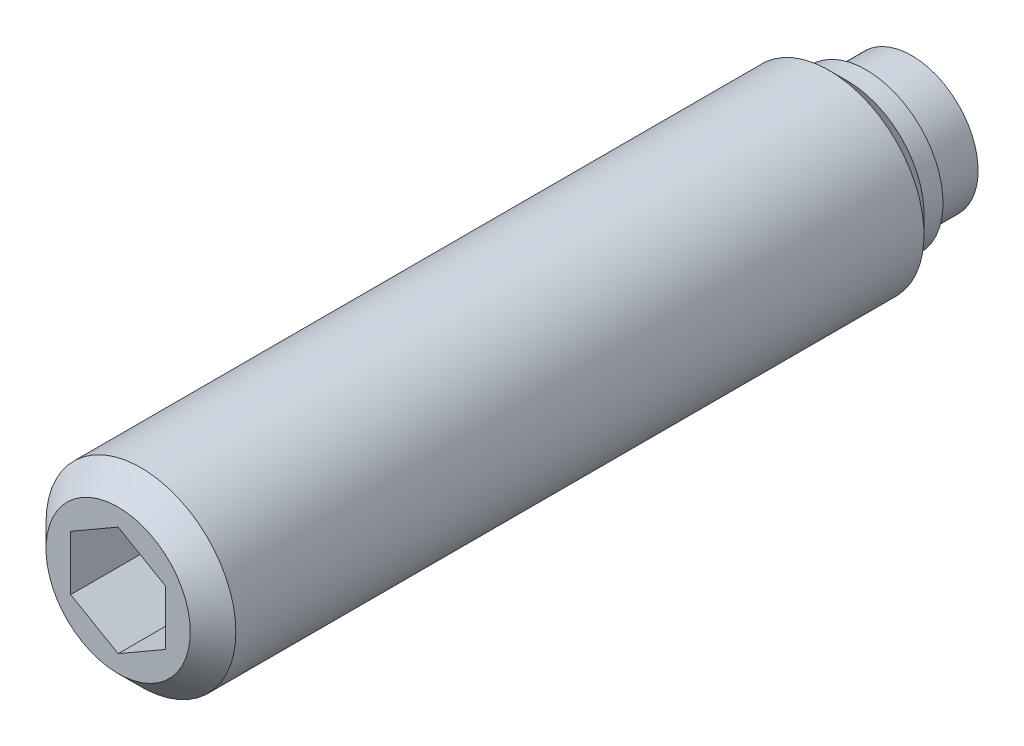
ISO-10303-21;
HEADER;
FILE_DESCRIPTION(('STEP AP214'),'2;1');
FILE_NAME('part.step','',(''),(''),'','','');
FILE_SCHEMA(('AUTOMOTIVE_DESIGN { 1 0 10303 214 1 1 1 1 }'));
ENDSEC;
DATA;
#1=APPLICATION_CONTEXT('core data for automotive mechanical design processes');
#2=APPLICATION_PROTOCOL_DEFINITION('international standard','automotive_design',2000,#1);
#3=PRODUCT_CONTEXT('',#1,'mechanical');
#4=PRODUCT('Part','Part','',(#3));
#5=PRODUCT_RELATED_PRODUCT_CATEGORY('part','',(#4));
#6=PRODUCT_DEFINITION_FORMATION('','',#4);
#7=PRODUCT_DEFINITION_CONTEXT('part definition',#1,'design');
#8=PRODUCT_DEFINITION('design','',#6,#7);
#9=PRODUCT_DEFINITION_SHAPE('','',#8);
#10=(LENGTH_UNIT() NAMED_UNIT(*) SI_UNIT(.MILLI.,.METRE.));
#11=(NAMED_UNIT(*) PLANE_ANGLE_UNIT() SI_UNIT($,.RADIAN.));
#12=(NAMED_UNIT(*) SI_UNIT($,.STERADIAN.) SOLID_ANGLE_UNIT());
#13=UNCERTAINTY_MEASURE_WITH_UNIT(LENGTH_MEASURE(1.E-05),#10,'distance_accuracy_value','');
#14=(GEOMETRIC_REPRESENTATION_CONTEXT(3) GLOBAL_UNCERTAINTY_ASSIGNED_CONTEXT((#13)) GLOBAL_UNIT_ASSIGNED_CONTEXT((#10,
#11,#12)) REPRESENTATION_CONTEXT('',''));
#15=CARTESIAN_POINT('',(0.,0.,0.));
#16=DIRECTION('',(0.,0.,1.));
#17=DIRECTION('',(1.,0.,0.));
#18=AXIS2_PLACEMENT_3D('',#15,#16,#17);
#19=CARTESIAN_POINT('',(0.,4.05,3.5));
#20=DIRECTION('',(0.,0.,1.));
#21=DIRECTION('',(1.,0.,0.));
#22=AXIS2_PLACEMENT_3D('',#19,#20,#21);
#23=PLANE('',#22);
#24=CARTESIAN_POINT('',(0.,0.,3.5));
#25=DIRECTION('',(0.,0.,-1.));
#26=DIRECTION('',(-1.,0.,0.));
#27=AXIS2_PLACEMENT_3D('',#24,#25,#26);
#28=CIRCLE('',#27,3.5);
#29=CARTESIAN_POINT('',(-3.50000000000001,0.,3.5));
#30=VERTEX_POINT('',#29);
#31=EDGE_CURVE('E124',#30,#30,#28,.T.);
#32=ORIENTED_EDGE('',*,*,#31,.F.);
#33=EDGE_LOOP('',(#32));
#34=FACE_BOUND('',#33,.T.);
#35=CARTESIAN_POINT('',(0.,0.,3.5));
#36=DIRECTION('',(0.,0.,-1.));
#37=DIRECTION('',(-1.,0.,0.));
#38=AXIS2_PLACEMENT_3D('',#35,#36,#37);
#39=CIRCLE('',#38,4.05);
#40=CARTESIAN_POINT('',(-4.05000000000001,0.,3.5));
#41=VERTEX_POINT('',#40);
#42=EDGE_CURVE('E127',#41,#41,#39,.T.);
#43=ORIENTED_EDGE('',*,*,#42,.T.);
#44=EDGE_LOOP('',(#43));
#45=FACE_BOUND('',#44,.T.);
#46=ADVANCED_FACE('F14',(#34,#45),#23,.F.);
#47=CARTESIAN_POINT('',(0.,0.,3.5));
#48=DIRECTION('',(0.,0.,-1.));
#49=DIRECTION('',(-1.,0.,0.));
#50=AXIS2_PLACEMENT_3D('',#47,#48,#49);
#51=CYLINDRICAL_SURFACE('',#50,5.);
#52=CARTESIAN_POINT('',(0.,0.,41.7));
#53=DIRECTION('',(0.,0.,1.));
#54=DIRECTION('',(1.,0.,0.));
#55=AXIS2_PLACEMENT_3D('',#52,#53,#54);
#56=CIRCLE('',#55,5.);
#57=CARTESIAN_POINT('',(4.99999999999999,0.,41.7));
#58=VERTEX_POINT('',#57);
#59=EDGE_CURVE('E9',#58,#58,#56,.F.);
#60=ORIENTED_EDGE('',*,*,#59,.T.);
#61=EDGE_LOOP('',(#60));
#62=FACE_BOUND('',#61,.T.);
#63=CARTESIAN_POINT('',(0.,0.,5.45));
#64=DIRECTION('',(0.,0.,-1.));
#65=DIRECTION('',(-1.,0.,0.));
#66=AXIS2_PLACEMENT_3D('',#63,#64,#65);
#67=CIRCLE('',#66,5.);
#68=CARTESIAN_POINT('',(-5.00000000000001,0.,5.45));
#69=VERTEX_POINT('',#68);
#70=EDGE_CURVE('E133',#69,#69,#67,.T.);
#71=ORIENTED_EDGE('',*,*,#70,.F.);
#72=EDGE_LOOP('',(#71));
#73=FACE_BOUND('',#72,.T.);
#74=ADVANCED_FACE('F151',(#62,#73),#51,.T.);
#75=CARTESIAN_POINT('',(0.,0.,5.45));
#76=DIRECTION('',(0.,0.,1.));
#77=DIRECTION('',(1.,0.,0.));
#78=AXIS2_PLACEMENT_3D('',#75,#76,#77);
#79=CONICAL_SURFACE('',#78,5.,0.785398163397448);
#80=CARTESIAN_POINT('',(0.,0.,4.5));
#81=DIRECTION('',(0.,0.,-1.));
#82=DIRECTION('',(-1.,0.,0.));
#83=AXIS2_PLACEMENT_3D('',#80,#81,#82);
#84=CIRCLE('',#83,4.05);
#85=CARTESIAN_POINT('',(-4.05000000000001,0.,4.5));
#86=VERTEX_POINT('',#85);
#87=EDGE_CURVE('E130',#86,#86,#84,.T.);
#88=ORIENTED_EDGE('',*,*,#87,.F.);
#89=EDGE_LOOP('',(#88));
#90=FACE_BOUND('',#89,.T.);
#91=ORIENTED_EDGE('',*,*,#70,.T.);
#92=EDGE_LOOP('',(#91));
#93=FACE_BOUND('',#92,.T.);
#94=ADVANCED_FACE('F158',(#90,#93),#79,.T.);
#95=CARTESIAN_POINT('',(0.,0.,3.5));
#96=DIRECTION('',(0.,0.,-1.));
#97=DIRECTION('',(-1.,0.,0.));
#98=AXIS2_PLACEMENT_3D('',#95,#96,#97);
#99=CYLINDRICAL_SURFACE('',#98,4.05);
#100=ORIENTED_EDGE('',*,*,#42,.F.);
#101=EDGE_LOOP('',(#100));
#102=FACE_BOUND('',#101,.T.);
#103=ORIENTED_EDGE('',*,*,#87,.T.);
#104=EDGE_LOOP('',(#103));
#105=FACE_BOUND('',#104,.T.);
#106=ADVANCED_FACE('F166',(#102,#105),#99,.T.);
#107=CARTESIAN_POINT('',(0.,0.,0.));
#108=DIRECTION('',(0.,0.,-1.));
#109=DIRECTION('',(-1.,0.,0.));
#110=AXIS2_PLACEMENT_3D('',#107,#108,#109);
#111=CYLINDRICAL_SURFACE('',#110,3.5);
#112=CARTESIAN_POINT('',(0.,0.,1.1));
#113=DIRECTION('',(0.,0.,-1.));
#114=DIRECTION('',(-1.,0.,0.));
#115=AXIS2_PLACEMENT_3D('',#112,#113,#114);
#116=CIRCLE('',#115,3.5);
#117=CARTESIAN_POINT('',(-3.50000000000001,0.,1.1));
#118=VERTEX_POINT('',#117);
#119=EDGE_CURVE('E114',#118,#118,#116,.T.);
#120=ORIENTED_EDGE('',*,*,#119,.F.);
#121=EDGE_LOOP('',(#120));
#122=FACE_BOUND('',#121,.T.);
#123=ORIENTED_EDGE('',*,*,#31,.T.);
#124=EDGE_LOOP('',(#123));
#125=FACE_BOUND('',#124,.T.);
#126=ADVANCED_FACE('F164',(#122,#125),#111,.T.);
#127=CARTESIAN_POINT('',(-0.0371790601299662,0.,5.9998848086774));
#128=DIRECTION('',(0.,-1.,0.));
#129=DIRECTION('',(-1.,0.,0.));
#130=AXIS2_PLACEMENT_3D('',#127,#128,#129);
#131=CIRCLE('',#130,5.99999999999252);
#132=TRIMMED_CURVE('',#131,(PARAMETER_VALUE(-1.57699287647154)),
(PARAMETER_VALUE(1.57699287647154)),.T.,.PARAMETER.);
#133=CARTESIAN_POINT('',(0.,0.,5.9998848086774));
#134=DIRECTION('',(0.,0.,-1.));
#135=AXIS1_PLACEMENT('',#133,#134);
#136=SURFACE_OF_REVOLUTION('',#132,#135);
#137=ORIENTED_EDGE('',*,*,#119,.T.);
#138=EDGE_LOOP('',(#137));
#139=FACE_BOUND('',#138,.T.);
#140=CARTESIAN_POINT('',(0.,0.,0.));
#141=VERTEX_POINT('',#140);
#142=VERTEX_LOOP('',#141);
#143=FACE_BOUND('',#142,.T.);
#144=ADVANCED_FACE('F198',(#139,#143),#136,.T.);
#145=CARTESIAN_POINT('',(0.,0.,42.9));
#146=DIRECTION('',(0.,0.,1.));
#147=DIRECTION('',(1.,0.,0.));
#148=AXIS2_PLACEMENT_3D('',#145,#146,#147);
#149=PLANE('',#148);
#150=CARTESIAN_POINT('',(0.,0.,42.9));
#151=DIRECTION('',(0.,0.,1.));
#152=DIRECTION('',(1.,0.,0.));
#153=AXIS2_PLACEMENT_3D('',#150,#151,#152);
#154=CIRCLE('',#153,3.8);
#155=CARTESIAN_POINT('',(3.79999999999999,0.,42.9));
#156=VERTEX_POINT('',#155);
#157=EDGE_CURVE('E22',#156,#156,#154,.T.);
#158=ORIENTED_EDGE('',*,*,#157,.T.);
#159=EDGE_LOOP('',(#158));
#160=FACE_BOUND('',#159,.T.);
#161=DIRECTION('',(-0.866025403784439,0.5,0.));
#162=VECTOR('',#161,1.);
#163=CARTESIAN_POINT('',(2.5,1.44337567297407,42.9));
#164=LINE('',#163,#162);
#165=CARTESIAN_POINT('',(2.5,1.44337567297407,42.9));
#166=VERTEX_POINT('',#165);
#167=CARTESIAN_POINT('',(0.,2.88675134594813,42.9));
#168=VERTEX_POINT('',#167);
#169=EDGE_CURVE('E29',#166,#168,#164,.T.);
#170=ORIENTED_EDGE('',*,*,#169,.F.);
#171=DIRECTION('',(0.,1.,0.));
#172=VECTOR('',#171,1.);
#173=CARTESIAN_POINT('',(2.5,-1.44337567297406,42.9));
#174=LINE('',#173,#172);
#175=CARTESIAN_POINT('',(2.5,-1.44337567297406,42.9));
#176=VERTEX_POINT('',#175);
#177=EDGE_CURVE('E88',#176,#166,#174,.T.);
#178=ORIENTED_EDGE('',*,*,#177,.F.);
#179=DIRECTION('',(0.866025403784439,0.5,0.));
#180=VECTOR('',#179,1.);
#181=CARTESIAN_POINT('',(0.,-2.88675134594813,42.9));
#182=LINE('',#181,#180);
#183=CARTESIAN_POINT('',(0.,-2.88675134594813,42.9));
#184=VERTEX_POINT('',#183);
#185=EDGE_CURVE('E91',#184,#176,#182,.T.);
#186=ORIENTED_EDGE('',*,*,#185,.F.);
#187=DIRECTION('',(0.866025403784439,-0.5,0.));
#188=VECTOR('',#187,1.);
#189=CARTESIAN_POINT('',(-2.5,-1.44337567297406,42.9));
#190=LINE('',#189,#188);
#191=CARTESIAN_POINT('',(-2.5,-1.44337567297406,42.9));
#192=VERTEX_POINT('',#191);
#193=EDGE_CURVE('E107',#192,#184,#190,.T.);
#194=ORIENTED_EDGE('',*,*,#193,.F.);
#195=DIRECTION('',(0.,-1.,0.));
#196=VECTOR('',#195,1.);
#197=CARTESIAN_POINT('',(-2.5,1.44337567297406,42.9));
#198=LINE('',#197,#196);
#199=CARTESIAN_POINT('',(-2.5,1.44337567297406,42.9));
#200=VERTEX_POINT('',#199);
#201=EDGE_CURVE('E104',#200,#192,#198,.T.);
#202=ORIENTED_EDGE('',*,*,#201,.F.);
#203=DIRECTION('',(-0.866025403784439,-0.5,0.));
#204=VECTOR('',#203,1.);
#205=CARTESIAN_POINT('',(0.,2.88675134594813,42.9));
#206=LINE('',#205,#204);
#207=EDGE_CURVE('E102',#168,#200,#206,.T.);
#208=ORIENTED_EDGE('',*,*,#207,.F.);
#209=EDGE_LOOP('',(#170,#178,#186,#194,#202,#208));
#210=FACE_BOUND('',#209,.T.);
#211=ADVANCED_FACE('F138',(#160,#210),#149,.T.);
#212=CARTESIAN_POINT('',(2.5,1.44337567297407,36.9));
#213=DIRECTION('',(0.5,0.866025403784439,0.));
#214=DIRECTION('',(-0.866025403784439,0.5,0.));
#215=AXIS2_PLACEMENT_3D('',#212,#213,#214);
#216=PLANE('',#215);
#217=ORIENTED_EDGE('',*,*,#169,.T.);
#218=DIRECTION('',(0.,0.,1.));
#219=VECTOR('',#218,1.);
#220=CARTESIAN_POINT('',(0.,2.88675134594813,36.9));
#221=LINE('',#220,#219);
#222=CARTESIAN_POINT('',(0.,2.88675134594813,36.9));
#223=VERTEX_POINT('',#222);
#224=EDGE_CURVE('E65',#223,#168,#221,.T.);
#225=ORIENTED_EDGE('',*,*,#224,.F.);
#226=DIRECTION('',(-0.866025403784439,0.5,0.));
#227=VECTOR('',#226,1.);
#228=CARTESIAN_POINT('',(2.5,1.44337567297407,36.9));
#229=LINE('',#228,#227);
#230=CARTESIAN_POINT('',(2.5,1.44337567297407,36.9));
#231=VERTEX_POINT('',#230);
#232=EDGE_CURVE('E69',#231,#223,#229,.T.);
#233=ORIENTED_EDGE('',*,*,#232,.F.);
#234=DIRECTION('',(0.,0.,1.));
#235=VECTOR('',#234,1.);
#236=CARTESIAN_POINT('',(2.5,1.44337567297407,36.9));
#237=LINE('',#236,#235);
#238=EDGE_CURVE('E112',#231,#166,#237,.T.);
#239=ORIENTED_EDGE('',*,*,#238,.T.);
#240=EDGE_LOOP('',(#217,#225,#233,#239));
#241=FACE_BOUND('',#240,.T.);
#242=ADVANCED_FACE('F67',(#241),#216,.F.);
#243=CARTESIAN_POINT('',(2.5,-1.44337567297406,36.9));
#244=DIRECTION('',(1.,0.,0.));
#245=DIRECTION('',(0.,0.,-1.));
#246=AXIS2_PLACEMENT_3D('',#243,#244,#245);
#247=PLANE('',#246);
#248=ORIENTED_EDGE('',*,*,#177,.T.);
#249=ORIENTED_EDGE('',*,*,#238,.F.);
#250=DIRECTION('',(0.,1.,0.));
#251=VECTOR('',#250,1.);
#252=CARTESIAN_POINT('',(2.5,-1.44337567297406,36.9));
#253=LINE('',#252,#251);
#254=CARTESIAN_POINT('',(2.5,-1.44337567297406,36.9));
#255=VERTEX_POINT('',#254);
#256=EDGE_CURVE('E75',#255,#231,#253,.T.);
#257=ORIENTED_EDGE('',*,*,#256,.F.);
#258=DIRECTION('',(0.,0.,1.));
#259=VECTOR('',#258,1.);
#260=CARTESIAN_POINT('',(2.5,-1.44337567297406,36.9));
#261=LINE('',#260,#259);
#262=EDGE_CURVE('E115',#255,#176,#261,.T.);
#263=ORIENTED_EDGE('',*,*,#262,.T.);
#264=EDGE_LOOP('',(#248,#249,#257,#263));
#265=FACE_BOUND('',#264,.T.);
#266=ADVANCED_FACE('F220',(#265),#247,.F.);
#267=CARTESIAN_POINT('',(0.,-2.88675134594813,36.9));
#268=DIRECTION('',(0.5,-0.866025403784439,0.));
#269=DIRECTION('',(0.866025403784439,0.5,0.));
#270=AXIS2_PLACEMENT_3D('',#267,#268,#269);
#271=PLANE('',#270);
#272=ORIENTED_EDGE('',*,*,#185,.T.);
#273=ORIENTED_EDGE('',*,*,#262,.F.);
#274=DIRECTION('',(0.866025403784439,0.5,0.));
#275=VECTOR('',#274,1.);
#276=CARTESIAN_POINT('',(0.,-2.88675134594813,36.9));
#277=LINE('',#276,#275);
#278=CARTESIAN_POINT('',(0.,-2.88675134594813,36.9));
#279=VERTEX_POINT('',#278);
#280=EDGE_CURVE('E98',#279,#255,#277,.T.);
#281=ORIENTED_EDGE('',*,*,#280,.F.);
#282=DIRECTION('',(0.,0.,1.));
#283=VECTOR('',#282,1.);
#284=CARTESIAN_POINT('',(0.,-2.88675134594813,36.9));
#285=LINE('',#284,#283);
#286=EDGE_CURVE('E117',#279,#184,#285,.T.);
#287=ORIENTED_EDGE('',*,*,#286,.T.);
#288=EDGE_LOOP('',(#272,#273,#281,#287));
#289=FACE_BOUND('',#288,.T.);
#290=ADVANCED_FACE('F228',(#289),#271,.F.);
#291=CARTESIAN_POINT('',(-2.5,-1.44337567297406,36.9));
#292=DIRECTION('',(-0.5,-0.866025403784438,0.));
#293=DIRECTION('',(0.866025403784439,-0.5,0.));
#294=AXIS2_PLACEMENT_3D('',#291,#292,#293);
#295=PLANE('',#294);
#296=ORIENTED_EDGE('',*,*,#193,.T.);
#297=ORIENTED_EDGE('',*,*,#286,.F.);
#298=DIRECTION('',(0.866025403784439,-0.5,0.));
#299=VECTOR('',#298,1.);
#300=CARTESIAN_POINT('',(-2.5,-1.44337567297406,36.9));
#301=LINE('',#300,#299);
#302=CARTESIAN_POINT('',(-2.5,-1.44337567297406,36.9));
#303=VERTEX_POINT('',#302);
#304=EDGE_CURVE('E95',#303,#279,#301,.T.);
#305=ORIENTED_EDGE('',*,*,#304,.F.);
#306=DIRECTION('',(0.,0.,1.));
#307=VECTOR('',#306,1.);
#308=CARTESIAN_POINT('',(-2.5,-1.44337567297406,36.9));
#309=LINE('',#308,#307);
#310=EDGE_CURVE('E119',#303,#192,#309,.T.);
#311=ORIENTED_EDGE('',*,*,#310,.T.);
#312=EDGE_LOOP('',(#296,#297,#305,#311));
#313=FACE_BOUND('',#312,.T.);
#314=ADVANCED_FACE('F237',(#313),#295,.F.);
#315=CARTESIAN_POINT('',(-2.5,1.44337567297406,36.9));
#316=DIRECTION('',(-1.,0.,0.));
#317=DIRECTION('',(0.,0.,1.));
#318=AXIS2_PLACEMENT_3D('',#315,#316,#317);
#319=PLANE('',#318);
#320=ORIENTED_EDGE('',*,*,#201,.T.);
#321=ORIENTED_EDGE('',*,*,#310,.F.);
#322=DIRECTION('',(0.,-1.,0.));
#323=VECTOR('',#322,1.);
#324=CARTESIAN_POINT('',(-2.5,1.44337567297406,36.9));
#325=LINE('',#324,#323);
#326=CARTESIAN_POINT('',(-2.5,1.44337567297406,36.9));
#327=VERTEX_POINT('',#326);
#328=EDGE_CURVE('E83',#327,#303,#325,.T.);
#329=ORIENTED_EDGE('',*,*,#328,.F.);
#330=DIRECTION('',(0.,0.,1.));
#331=VECTOR('',#330,1.);
#332=CARTESIAN_POINT('',(-2.5,1.44337567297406,36.9));
#333=LINE('',#332,#331);
#334=EDGE_CURVE('E74',#327,#200,#333,.T.);
#335=ORIENTED_EDGE('',*,*,#334,.T.);
#336=EDGE_LOOP('',(#320,#321,#329,#335));
#337=FACE_BOUND('',#336,.T.);
#338=ADVANCED_FACE('F246',(#337),#319,.F.);
#339=CARTESIAN_POINT('',(0.,2.88675134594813,36.9));
#340=DIRECTION('',(-0.5,0.866025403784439,0.));
#341=DIRECTION('',(-0.866025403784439,-0.5,0.));
#342=AXIS2_PLACEMENT_3D('',#339,#340,#341);
#343=PLANE('',#342);
#344=ORIENTED_EDGE('',*,*,#207,.T.);
#345=ORIENTED_EDGE('',*,*,#334,.F.);
#346=DIRECTION('',(-0.866025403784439,-0.5,0.));
#347=VECTOR('',#346,1.);
#348=CARTESIAN_POINT('',(0.,2.88675134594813,36.9));
#349=LINE('',#348,#347);
#350=EDGE_CURVE('E78',#223,#327,#349,.T.);
#351=ORIENTED_EDGE('',*,*,#350,.F.);
#352=ORIENTED_EDGE('',*,*,#224,.T.);
#353=EDGE_LOOP('',(#344,#345,#351,#352));
#354=FACE_BOUND('',#353,.T.);
#355=ADVANCED_FACE('F79',(#354),#343,.F.);
#356=CARTESIAN_POINT('',(0.,0.,36.9));
#357=DIRECTION('',(0.,0.,1.));
#358=DIRECTION('',(1.,0.,0.));
#359=AXIS2_PLACEMENT_3D('',#356,#357,#358);
#360=PLANE('',#359);
#361=ORIENTED_EDGE('',*,*,#232,.T.);
#362=ORIENTED_EDGE('',*,*,#350,.T.);
#363=ORIENTED_EDGE('',*,*,#328,.T.);
#364=ORIENTED_EDGE('',*,*,#304,.T.);
#365=ORIENTED_EDGE('',*,*,#280,.T.);
#366=ORIENTED_EDGE('',*,*,#256,.T.);
#367=EDGE_LOOP('',(#361,#362,#363,#364,#365,#366));
#368=FACE_BOUND('',#367,.T.);
#369=ADVANCED_FACE('F85',(#368),#360,.T.);
#370=CARTESIAN_POINT('',(0.,0.,42.9));
#371=DIRECTION('',(0.,0.,-1.));
#372=DIRECTION('',(-1.,0.,0.));
#373=AXIS2_PLACEMENT_3D('',#370,#371,#372);
#374=CONICAL_SURFACE('',#373,3.8,0.785398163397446);
#375=ORIENTED_EDGE('',*,*,#59,.F.);
#376=EDGE_LOOP('',(#375));
#377=FACE_BOUND('',#376,.T.);
#378=ORIENTED_EDGE('',*,*,#157,.F.);
#379=EDGE_LOOP('',(#378));
#380=FACE_BOUND('',#379,.T.);
#381=ADVANCED_FACE('F16',(#377,#380),#374,.T.);
#382=CLOSED_SHELL('',(#46,#74,#94,#106,#126,#144,#211,#242,#266,#290,#314,#338,#355,#369,#381));
#383=MANIFOLD_SOLID_BREP('B1',#382);
#384=ADVANCED_BREP_SHAPE_REPRESENTATION('',(#18,#383),#14);
#385=SHAPE_DEFINITION_REPRESENTATION(#9,#384);
ENDSEC;
END-ISO-10303-21;
